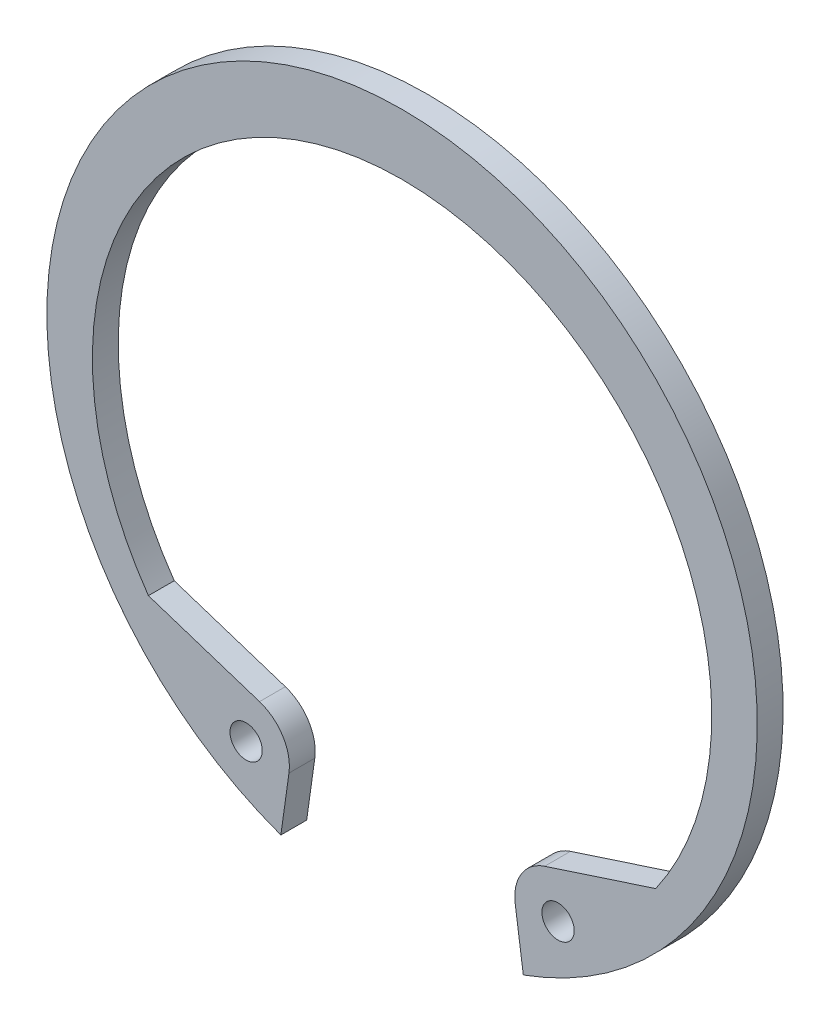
ISO-10303-21;
HEADER;
FILE_DESCRIPTION(('STEP AP214'),'2;1');
FILE_NAME('part.step','',(''),(''),'','','');
FILE_SCHEMA(('AUTOMOTIVE_DESIGN { 1 0 10303 214 1 1 1 1 }'));
ENDSEC;
DATA;
#1=APPLICATION_CONTEXT('core data for automotive mechanical design processes');
#2=APPLICATION_PROTOCOL_DEFINITION('international standard','automotive_design',2000,#1);
#3=PRODUCT_CONTEXT('',#1,'mechanical');
#4=PRODUCT('Part','Part','',(#3));
#5=PRODUCT_RELATED_PRODUCT_CATEGORY('part','',(#4));
#6=PRODUCT_DEFINITION_FORMATION('','',#4);
#7=PRODUCT_DEFINITION_CONTEXT('part definition',#1,'design');
#8=PRODUCT_DEFINITION('design','',#6,#7);
#9=PRODUCT_DEFINITION_SHAPE('','',#8);
#10=(LENGTH_UNIT() NAMED_UNIT(*) SI_UNIT(.MILLI.,.METRE.));
#11=(NAMED_UNIT(*) PLANE_ANGLE_UNIT() SI_UNIT($,.RADIAN.));
#12=(NAMED_UNIT(*) SI_UNIT($,.STERADIAN.) SOLID_ANGLE_UNIT());
#13=UNCERTAINTY_MEASURE_WITH_UNIT(LENGTH_MEASURE(1.E-05),#10,'distance_accuracy_value','');
#14=(GEOMETRIC_REPRESENTATION_CONTEXT(3) GLOBAL_UNCERTAINTY_ASSIGNED_CONTEXT((#13)) GLOBAL_UNIT_ASSIGNED_CONTEXT((#10,
#11,#12)) REPRESENTATION_CONTEXT('',''));
#15=CARTESIAN_POINT('',(0.,0.,0.));
#16=DIRECTION('',(0.,0.,1.));
#17=DIRECTION('',(1.,0.,0.));
#18=AXIS2_PLACEMENT_3D('',#15,#16,#17);
#19=CARTESIAN_POINT('',(-11.0371564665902,-17.7293320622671,2.));
#20=DIRECTION('',(-0.30980403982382,-0.950800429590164,0.));
#21=DIRECTION('',(0.950800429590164,-0.30980403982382,0.));
#22=AXIS2_PLACEMENT_3D('',#19,#20,#21);
#23=PLANE('',#22);
#24=DIRECTION('',(-0.950800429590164,0.30980403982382,0.));
#25=VECTOR('',#24,1.);
#26=CARTESIAN_POINT('',(-11.0371564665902,-17.7293320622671,0.));
#27=LINE('',#26,#25);
#28=CARTESIAN_POINT('',(-11.0371564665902,-17.7293320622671,0.));
#29=VERTEX_POINT('',#28);
#30=CARTESIAN_POINT('',(-19.6391702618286,-14.9264950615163,0.));
#31=VERTEX_POINT('',#30);
#32=EDGE_CURVE('E111',#29,#31,#27,.T.);
#33=ORIENTED_EDGE('',*,*,#32,.T.);
#34=DIRECTION('',(0.,0.,-1.));
#35=VECTOR('',#34,1.);
#36=CARTESIAN_POINT('',(-19.6391702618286,-14.9264950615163,2.));
#37=LINE('',#36,#35);
#38=CARTESIAN_POINT('',(-19.6391702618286,-14.9264950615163,2.));
#39=VERTEX_POINT('',#38);
#40=EDGE_CURVE('E11',#39,#31,#37,.T.);
#41=ORIENTED_EDGE('',*,*,#40,.F.);
#42=DIRECTION('',(-0.950800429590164,0.30980403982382,0.));
#43=VECTOR('',#42,1.);
#44=CARTESIAN_POINT('',(-11.0371564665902,-17.7293320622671,2.));
#45=LINE('',#44,#43);
#46=CARTESIAN_POINT('',(-11.0371564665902,-17.7293320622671,2.));
#47=VERTEX_POINT('',#46);
#48=EDGE_CURVE('E131',#47,#39,#45,.T.);
#49=ORIENTED_EDGE('',*,*,#48,.F.);
#50=DIRECTION('',(0.,0.,-1.));
#51=VECTOR('',#50,1.);
#52=CARTESIAN_POINT('',(-11.0371564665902,-17.7293320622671,2.));
#53=LINE('',#52,#51);
#54=EDGE_CURVE('E146',#47,#29,#53,.T.);
#55=ORIENTED_EDGE('',*,*,#54,.T.);
#56=EDGE_LOOP('',(#33,#41,#49,#55));
#57=FACE_BOUND('',#56,.T.);
#58=ADVANCED_FACE('F30',(#57),#23,.F.);
#59=CARTESIAN_POINT('',(0.,-1.175,2.));
#60=DIRECTION('',(0.,0.,-1.));
#61=DIRECTION('',(-1.,0.,0.));
#62=AXIS2_PLACEMENT_3D('',#59,#60,#61);
#63=CYLINDRICAL_SURFACE('',#62,23.975);
#64=CARTESIAN_POINT('',(0.,-1.175,0.));
#65=DIRECTION('',(0.,0.,1.));
#66=DIRECTION('',(1.,0.,0.));
#67=AXIS2_PLACEMENT_3D('',#64,#65,#66);
#68=CIRCLE('',#67,23.975);
#69=CARTESIAN_POINT('',(19.6391702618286,-14.9264950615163,0.));
#70=VERTEX_POINT('',#69);
#71=EDGE_CURVE('E105',#70,#31,#68,.T.);
#72=ORIENTED_EDGE('',*,*,#71,.F.);
#73=DIRECTION('',(0.,0.,-1.));
#74=VECTOR('',#73,1.);
#75=CARTESIAN_POINT('',(19.6391702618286,-14.9264950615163,2.));
#76=LINE('',#75,#74);
#77=CARTESIAN_POINT('',(19.6391702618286,-14.9264950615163,2.));
#78=VERTEX_POINT('',#77);
#79=EDGE_CURVE('E33',#78,#70,#76,.T.);
#80=ORIENTED_EDGE('',*,*,#79,.F.);
#81=CARTESIAN_POINT('',(0.,-1.175,2.));
#82=DIRECTION('',(0.,0.,1.));
#83=DIRECTION('',(1.,0.,0.));
#84=AXIS2_PLACEMENT_3D('',#81,#82,#83);
#85=CIRCLE('',#84,23.975);
#86=EDGE_CURVE('E134',#78,#39,#85,.T.);
#87=ORIENTED_EDGE('',*,*,#86,.T.);
#88=ORIENTED_EDGE('',*,*,#40,.T.);
#89=EDGE_LOOP('',(#72,#80,#87,#88));
#90=FACE_BOUND('',#89,.T.);
#91=ADVANCED_FACE('F106',(#90),#63,.F.);
#92=CARTESIAN_POINT('',(11.0371564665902,-17.7293320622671,2.));
#93=DIRECTION('',(-0.309804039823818,0.950800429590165,0.));
#94=DIRECTION('',(-0.950800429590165,-0.309804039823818,0.));
#95=AXIS2_PLACEMENT_3D('',#92,#93,#94);
#96=PLANE('',#95);
#97=DIRECTION('',(0.950800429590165,0.309804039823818,0.));
#98=VECTOR('',#97,1.);
#99=CARTESIAN_POINT('',(11.0371564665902,-17.7293320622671,0.));
#100=LINE('',#99,#98);
#101=CARTESIAN_POINT('',(11.0371564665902,-17.7293320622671,0.));
#102=VERTEX_POINT('',#101);
#103=EDGE_CURVE('E97',#102,#70,#100,.T.);
#104=ORIENTED_EDGE('',*,*,#103,.F.);
#105=DIRECTION('',(0.,0.,-1.));
#106=VECTOR('',#105,1.);
#107=CARTESIAN_POINT('',(11.0371564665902,-17.7293320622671,2.));
#108=LINE('',#107,#106);
#109=CARTESIAN_POINT('',(11.0371564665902,-17.7293320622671,2.));
#110=VERTEX_POINT('',#109);
#111=EDGE_CURVE('E103',#110,#102,#108,.T.);
#112=ORIENTED_EDGE('',*,*,#111,.F.);
#113=DIRECTION('',(0.950800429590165,0.309804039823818,0.));
#114=VECTOR('',#113,1.);
#115=CARTESIAN_POINT('',(11.0371564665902,-17.7293320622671,2.));
#116=LINE('',#115,#114);
#117=EDGE_CURVE('E99',#110,#78,#116,.T.);
#118=ORIENTED_EDGE('',*,*,#117,.T.);
#119=ORIENTED_EDGE('',*,*,#79,.T.);
#120=EDGE_LOOP('',(#104,#112,#118,#119));
#121=FACE_BOUND('',#120,.T.);
#122=ADVANCED_FACE('F95',(#121),#96,.T.);
#123=CARTESIAN_POINT('',(12.075,-20.9145135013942,2.));
#124=DIRECTION('',(0.,0.,-1.));
#125=DIRECTION('',(-1.,0.,0.));
#126=AXIS2_PLACEMENT_3D('',#123,#124,#125);
#127=CYLINDRICAL_SURFACE('',#126,3.35);
#128=CARTESIAN_POINT('',(12.075,-20.9145135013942,0.));
#129=DIRECTION('',(0.,0.,1.));
#130=DIRECTION('',(1.,0.,0.));
#131=AXIS2_PLACEMENT_3D('',#128,#129,#130);
#132=CIRCLE('',#131,3.35);
#133=CARTESIAN_POINT('',(8.75760196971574,-21.3807433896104,0.));
#134=VERTEX_POINT('',#133);
#135=EDGE_CURVE('E116',#102,#134,#132,.T.);
#136=ORIENTED_EDGE('',*,*,#135,.T.);
#137=DIRECTION('',(0.,0.,-1.));
#138=VECTOR('',#137,1.);
#139=CARTESIAN_POINT('',(8.75760196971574,-21.3807433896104,2.));
#140=LINE('',#139,#138);
#141=CARTESIAN_POINT('',(8.75760196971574,-21.3807433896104,2.));
#142=VERTEX_POINT('',#141);
#143=EDGE_CURVE('E156',#142,#134,#140,.T.);
#144=ORIENTED_EDGE('',*,*,#143,.F.);
#145=CARTESIAN_POINT('',(12.075,-20.9145135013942,2.));
#146=DIRECTION('',(0.,0.,1.));
#147=DIRECTION('',(1.,0.,0.));
#148=AXIS2_PLACEMENT_3D('',#145,#146,#147);
#149=CIRCLE('',#148,3.35);
#150=EDGE_CURVE('E137',#110,#142,#149,.T.);
#151=ORIENTED_EDGE('',*,*,#150,.F.);
#152=ORIENTED_EDGE('',*,*,#111,.T.);
#153=EDGE_LOOP('',(#136,#144,#151,#152));
#154=FACE_BOUND('',#153,.T.);
#155=ADVANCED_FACE('F161',(#154),#127,.T.);
#156=CARTESIAN_POINT('',(8.75760196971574,-21.3807433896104,2.));
#157=DIRECTION('',(0.990268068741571,0.139173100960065,0.));
#158=DIRECTION('',(-0.139173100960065,0.990268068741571,0.));
#159=AXIS2_PLACEMENT_3D('',#156,#157,#158);
#160=PLANE('',#159);
#161=DIRECTION('',(0.139173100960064,-0.99026806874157,0.));
#162=VECTOR('',#161,1.);
#163=CARTESIAN_POINT('',(8.75760196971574,-21.3807433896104,0.));
#164=LINE('',#163,#162);
#165=CARTESIAN_POINT('',(9.3855491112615,-25.8488194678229,0.));
#166=VERTEX_POINT('',#165);
#167=EDGE_CURVE('E118',#134,#166,#164,.T.);
#168=ORIENTED_EDGE('',*,*,#167,.T.);
#169=DIRECTION('',(0.,0.,-1.));
#170=VECTOR('',#169,1.);
#171=CARTESIAN_POINT('',(9.3855491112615,-25.8488194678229,2.));
#172=LINE('',#171,#170);
#173=CARTESIAN_POINT('',(9.3855491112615,-25.8488194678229,2.));
#174=VERTEX_POINT('',#173);
#175=EDGE_CURVE('E153',#174,#166,#172,.T.);
#176=ORIENTED_EDGE('',*,*,#175,.F.);
#177=DIRECTION('',(0.139173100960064,-0.99026806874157,0.));
#178=VECTOR('',#177,1.);
#179=CARTESIAN_POINT('',(8.75760196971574,-21.3807433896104,2.));
#180=LINE('',#179,#178);
#181=EDGE_CURVE('E139',#142,#174,#180,.T.);
#182=ORIENTED_EDGE('',*,*,#181,.F.);
#183=ORIENTED_EDGE('',*,*,#143,.T.);
#184=EDGE_LOOP('',(#168,#176,#182,#183));
#185=FACE_BOUND('',#184,.T.);
#186=ADVANCED_FACE('F177',(#185),#160,.F.);
#187=CARTESIAN_POINT('',(0.,0.,2.));
#188=DIRECTION('',(0.,0.,-1.));
#189=DIRECTION('',(-1.,0.,0.));
#190=AXIS2_PLACEMENT_3D('',#187,#188,#189);
#191=CYLINDRICAL_SURFACE('',#190,27.5);
#192=CARTESIAN_POINT('',(0.,0.,0.));
#193=DIRECTION('',(0.,0.,1.));
#194=DIRECTION('',(1.,0.,0.));
#195=AXIS2_PLACEMENT_3D('',#192,#193,#194);
#196=CIRCLE('',#195,27.5);
#197=CARTESIAN_POINT('',(-9.38554911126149,-25.8488194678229,0.));
#198=VERTEX_POINT('',#197);
#199=EDGE_CURVE('E123',#166,#198,#196,.T.);
#200=ORIENTED_EDGE('',*,*,#199,.T.);
#201=DIRECTION('',(0.,0.,-1.));
#202=VECTOR('',#201,1.);
#203=CARTESIAN_POINT('',(-9.38554911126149,-25.8488194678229,2.));
#204=LINE('',#203,#202);
#205=CARTESIAN_POINT('',(-9.38554911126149,-25.8488194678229,2.));
#206=VERTEX_POINT('',#205);
#207=EDGE_CURVE('E151',#206,#198,#204,.T.);
#208=ORIENTED_EDGE('',*,*,#207,.F.);
#209=CARTESIAN_POINT('',(0.,0.,2.));
#210=DIRECTION('',(0.,0.,1.));
#211=DIRECTION('',(1.,0.,0.));
#212=AXIS2_PLACEMENT_3D('',#209,#210,#211);
#213=CIRCLE('',#212,27.5);
#214=EDGE_CURVE('E141',#174,#206,#213,.T.);
#215=ORIENTED_EDGE('',*,*,#214,.F.);
#216=ORIENTED_EDGE('',*,*,#175,.T.);
#217=EDGE_LOOP('',(#200,#208,#215,#216));
#218=FACE_BOUND('',#217,.T.);
#219=ADVANCED_FACE('F174',(#218),#191,.T.);
#220=CARTESIAN_POINT('',(-8.75760196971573,-21.3807433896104,2.));
#221=DIRECTION('',(0.990268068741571,-0.139173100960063,0.));
#222=DIRECTION('',(0.139173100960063,0.990268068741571,0.));
#223=AXIS2_PLACEMENT_3D('',#220,#221,#222);
#224=PLANE('',#223);
#225=DIRECTION('',(-0.139173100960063,-0.99026806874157,0.));
#226=VECTOR('',#225,1.);
#227=CARTESIAN_POINT('',(-8.75760196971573,-21.3807433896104,0.));
#228=LINE('',#227,#226);
#229=CARTESIAN_POINT('',(-8.75760196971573,-21.3807433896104,0.));
#230=VERTEX_POINT('',#229);
#231=EDGE_CURVE('E126',#230,#198,#228,.T.);
#232=ORIENTED_EDGE('',*,*,#231,.F.);
#233=DIRECTION('',(0.,0.,-1.));
#234=VECTOR('',#233,1.);
#235=CARTESIAN_POINT('',(-8.75760196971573,-21.3807433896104,2.));
#236=LINE('',#235,#234);
#237=CARTESIAN_POINT('',(-8.75760196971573,-21.3807433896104,2.));
#238=VERTEX_POINT('',#237);
#239=EDGE_CURVE('E52',#238,#230,#236,.T.);
#240=ORIENTED_EDGE('',*,*,#239,.F.);
#241=DIRECTION('',(-0.139173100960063,-0.99026806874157,0.));
#242=VECTOR('',#241,1.);
#243=CARTESIAN_POINT('',(-8.75760196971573,-21.3807433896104,2.));
#244=LINE('',#243,#242);
#245=EDGE_CURVE('E143',#238,#206,#244,.T.);
#246=ORIENTED_EDGE('',*,*,#245,.T.);
#247=ORIENTED_EDGE('',*,*,#207,.T.);
#248=EDGE_LOOP('',(#232,#240,#246,#247));
#249=FACE_BOUND('',#248,.T.);
#250=ADVANCED_FACE('F170',(#249),#224,.T.);
#251=CARTESIAN_POINT('',(-12.075,-20.9145135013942,2.));
#252=DIRECTION('',(0.,0.,-1.));
#253=DIRECTION('',(-1.,0.,0.));
#254=AXIS2_PLACEMENT_3D('',#251,#252,#253);
#255=CYLINDRICAL_SURFACE('',#254,3.35);
#256=CARTESIAN_POINT('',(-12.075,-20.9145135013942,0.));
#257=DIRECTION('',(0.,0.,1.));
#258=DIRECTION('',(1.,0.,0.));
#259=AXIS2_PLACEMENT_3D('',#256,#257,#258);
#260=CIRCLE('',#259,3.35);
#261=EDGE_CURVE('E129',#230,#29,#260,.T.);
#262=ORIENTED_EDGE('',*,*,#261,.T.);
#263=ORIENTED_EDGE('',*,*,#54,.F.);
#264=CARTESIAN_POINT('',(-12.075,-20.9145135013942,2.));
#265=DIRECTION('',(0.,0.,1.));
#266=DIRECTION('',(1.,0.,0.));
#267=AXIS2_PLACEMENT_3D('',#264,#265,#266);
#268=CIRCLE('',#267,3.35);
#269=EDGE_CURVE('E44',#238,#47,#268,.T.);
#270=ORIENTED_EDGE('',*,*,#269,.F.);
#271=ORIENTED_EDGE('',*,*,#239,.T.);
#272=EDGE_LOOP('',(#262,#263,#270,#271));
#273=FACE_BOUND('',#272,.T.);
#274=ADVANCED_FACE('F213',(#273),#255,.T.);
#275=CARTESIAN_POINT('',(0.,-1.175,2.));
#276=DIRECTION('',(0.,0.,1.));
#277=DIRECTION('',(1.,0.,0.));
#278=AXIS2_PLACEMENT_3D('',#275,#276,#277);
#279=PLANE('',#278);
#280=CARTESIAN_POINT('',(12.075,-20.9145135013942,2.));
#281=DIRECTION('',(0.,0.,-1.));
#282=DIRECTION('',(0.,1.,0.));
#283=AXIS2_PLACEMENT_3D('',#280,#281,#282);
#284=CIRCLE('',#283,1.25);
#285=CARTESIAN_POINT('',(12.075,-19.6645135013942,2.));
#286=VERTEX_POINT('',#285);
#287=EDGE_CURVE('E254',#286,#286,#284,.T.);
#288=ORIENTED_EDGE('',*,*,#287,.T.);
#289=EDGE_LOOP('',(#288));
#290=FACE_BOUND('',#289,.T.);
#291=CARTESIAN_POINT('',(-12.075,-20.9145135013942,2.));
#292=DIRECTION('',(0.,0.,-1.));
#293=DIRECTION('',(0.,1.,0.));
#294=AXIS2_PLACEMENT_3D('',#291,#292,#293);
#295=CIRCLE('',#294,1.25);
#296=CARTESIAN_POINT('',(-12.075,-19.6645135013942,2.));
#297=VERTEX_POINT('',#296);
#298=EDGE_CURVE('E133',#297,#297,#295,.T.);
#299=ORIENTED_EDGE('',*,*,#298,.T.);
#300=EDGE_LOOP('',(#299));
#301=FACE_BOUND('',#300,.T.);
#302=ORIENTED_EDGE('',*,*,#48,.T.);
#303=ORIENTED_EDGE('',*,*,#86,.F.);
#304=ORIENTED_EDGE('',*,*,#117,.F.);
#305=ORIENTED_EDGE('',*,*,#150,.T.);
#306=ORIENTED_EDGE('',*,*,#181,.T.);
#307=ORIENTED_EDGE('',*,*,#214,.T.);
#308=ORIENTED_EDGE('',*,*,#245,.F.);
#309=ORIENTED_EDGE('',*,*,#269,.T.);
#310=EDGE_LOOP('',(#302,#303,#304,#305,#306,#307,#308,#309));
#311=FACE_BOUND('',#310,.T.);
#312=ADVANCED_FACE('F164',(#290,#301,#311),#279,.T.);
#313=CARTESIAN_POINT('',(0.,-1.175,0.));
#314=DIRECTION('',(0.,0.,1.));
#315=DIRECTION('',(1.,0.,0.));
#316=AXIS2_PLACEMENT_3D('',#313,#314,#315);
#317=PLANE('',#316);
#318=CARTESIAN_POINT('',(12.075,-20.9145135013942,0.));
#319=DIRECTION('',(0.,0.,1.));
#320=DIRECTION('',(0.,1.,0.));
#321=AXIS2_PLACEMENT_3D('',#318,#319,#320);
#322=CIRCLE('',#321,1.25);
#323=CARTESIAN_POINT('',(12.075,-19.6645135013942,0.));
#324=VERTEX_POINT('',#323);
#325=EDGE_CURVE('E257',#324,#324,#322,.T.);
#326=ORIENTED_EDGE('',*,*,#325,.T.);
#327=EDGE_LOOP('',(#326));
#328=FACE_BOUND('',#327,.T.);
#329=CARTESIAN_POINT('',(-12.075,-20.9145135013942,0.));
#330=DIRECTION('',(0.,0.,1.));
#331=DIRECTION('',(0.,1.,0.));
#332=AXIS2_PLACEMENT_3D('',#329,#330,#331);
#333=CIRCLE('',#332,1.25);
#334=CARTESIAN_POINT('',(-12.075,-19.6645135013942,0.));
#335=VERTEX_POINT('',#334);
#336=EDGE_CURVE('E259',#335,#335,#333,.T.);
#337=ORIENTED_EDGE('',*,*,#336,.T.);
#338=EDGE_LOOP('',(#337));
#339=FACE_BOUND('',#338,.T.);
#340=ORIENTED_EDGE('',*,*,#32,.F.);
#341=ORIENTED_EDGE('',*,*,#261,.F.);
#342=ORIENTED_EDGE('',*,*,#231,.T.);
#343=ORIENTED_EDGE('',*,*,#199,.F.);
#344=ORIENTED_EDGE('',*,*,#167,.F.);
#345=ORIENTED_EDGE('',*,*,#135,.F.);
#346=ORIENTED_EDGE('',*,*,#103,.T.);
#347=ORIENTED_EDGE('',*,*,#71,.T.);
#348=EDGE_LOOP('',(#340,#341,#342,#343,#344,#345,#346,#347));
#349=FACE_BOUND('',#348,.T.);
#350=ADVANCED_FACE('F114',(#328,#339,#349),#317,.F.);
#351=CARTESIAN_POINT('',(-12.075,-20.9145135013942,0.));
#352=DIRECTION('',(0.,0.,1.));
#353=DIRECTION('',(0.,1.,0.));
#354=AXIS2_PLACEMENT_3D('',#351,#352,#353);
#355=CYLINDRICAL_SURFACE('',#354,1.25);
#356=ORIENTED_EDGE('',*,*,#298,.F.);
#357=EDGE_LOOP('',(#356));
#358=FACE_BOUND('',#357,.T.);
#359=ORIENTED_EDGE('',*,*,#336,.F.);
#360=EDGE_LOOP('',(#359));
#361=FACE_BOUND('',#360,.T.);
#362=ADVANCED_FACE('F233',(#358,#361),#355,.F.);
#363=CARTESIAN_POINT('',(12.075,-20.9145135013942,0.));
#364=DIRECTION('',(0.,0.,1.));
#365=DIRECTION('',(0.,1.,0.));
#366=AXIS2_PLACEMENT_3D('',#363,#364,#365);
#367=CYLINDRICAL_SURFACE('',#366,1.25);
#368=ORIENTED_EDGE('',*,*,#287,.F.);
#369=EDGE_LOOP('',(#368));
#370=FACE_BOUND('',#369,.T.);
#371=ORIENTED_EDGE('',*,*,#325,.F.);
#372=EDGE_LOOP('',(#371));
#373=FACE_BOUND('',#372,.T.);
#374=ADVANCED_FACE('F241',(#370,#373),#367,.F.);
#375=CLOSED_SHELL('',(#58,#91,#122,#155,#186,#219,#250,#274,#312,#350,#362,#374));
#376=MANIFOLD_SOLID_BREP('B2',#375);
#377=ADVANCED_BREP_SHAPE_REPRESENTATION('',(#18,#376),#14);
#378=SHAPE_DEFINITION_REPRESENTATION(#9,#377);
ENDSEC;
END-ISO-10303-21;
